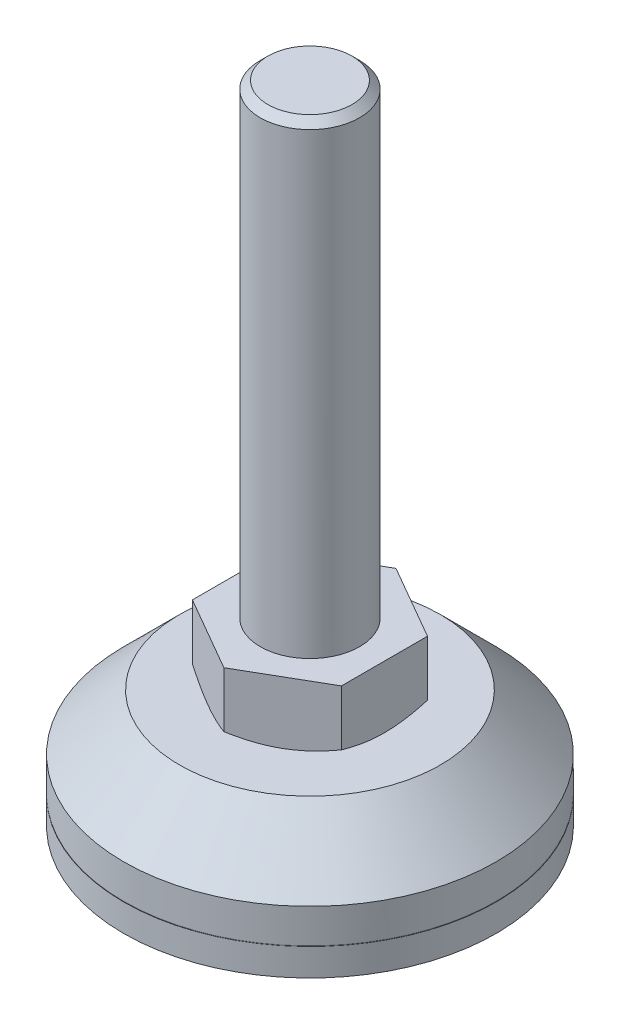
ISO-10303-21;
HEADER;
FILE_DESCRIPTION(('STEP AP214'),'2;1');
FILE_NAME('part.step','',(''),(''),'','','');
FILE_SCHEMA(('AUTOMOTIVE_DESIGN { 1 0 10303 214 1 1 1 1 }'));
ENDSEC;
DATA;
#1=APPLICATION_CONTEXT('core data for automotive mechanical design processes');
#2=APPLICATION_PROTOCOL_DEFINITION('international standard','automotive_design',2000,#1);
#3=PRODUCT_CONTEXT('',#1,'mechanical');
#4=PRODUCT('Part','Part','',(#3));
#5=PRODUCT_RELATED_PRODUCT_CATEGORY('part','',(#4));
#6=PRODUCT_DEFINITION_FORMATION('','',#4);
#7=PRODUCT_DEFINITION_CONTEXT('part definition',#1,'design');
#8=PRODUCT_DEFINITION('design','',#6,#7);
#9=PRODUCT_DEFINITION_SHAPE('','',#8);
#10=(LENGTH_UNIT() NAMED_UNIT(*) SI_UNIT(.MILLI.,.METRE.));
#11=(NAMED_UNIT(*) PLANE_ANGLE_UNIT() SI_UNIT($,.RADIAN.));
#12=(NAMED_UNIT(*) SI_UNIT($,.STERADIAN.) SOLID_ANGLE_UNIT());
#13=UNCERTAINTY_MEASURE_WITH_UNIT(LENGTH_MEASURE(1.E-05),#10,'distance_accuracy_value','');
#14=(GEOMETRIC_REPRESENTATION_CONTEXT(3) GLOBAL_UNCERTAINTY_ASSIGNED_CONTEXT((#13)) GLOBAL_UNIT_ASSIGNED_CONTEXT((#10,
#11,#12)) REPRESENTATION_CONTEXT('',''));
#15=CARTESIAN_POINT('',(0.,0.,0.));
#16=DIRECTION('',(0.,0.,1.));
#17=DIRECTION('',(1.,0.,0.));
#18=AXIS2_PLACEMENT_3D('',#15,#16,#17);
#19=CARTESIAN_POINT('',(0.,0.,-30.));
#20=DIRECTION('',(0.,1.,0.));
#21=DIRECTION('',(0.,0.,1.));
#22=AXIS2_PLACEMENT_3D('',#19,#20,#21);
#23=PLANE('',#22);
#24=CARTESIAN_POINT('',(0.,0.,0.));
#25=DIRECTION('',(0.,1.,0.));
#26=DIRECTION('',(0.,0.,1.));
#27=AXIS2_PLACEMENT_3D('',#24,#25,#26);
#28=CIRCLE('',#27,30.);
#29=CARTESIAN_POINT('',(0.,0.,30.));
#30=VERTEX_POINT('',#29);
#31=EDGE_CURVE('E19',#30,#30,#28,.T.);
#32=ORIENTED_EDGE('',*,*,#31,.F.);
#33=EDGE_LOOP('',(#32));
#34=FACE_BOUND('',#33,.T.);
#35=ADVANCED_FACE('F16',(#34),#23,.F.);
#36=CARTESIAN_POINT('',(0.,19.,0.));
#37=DIRECTION('',(0.,1.,0.));
#38=DIRECTION('',(0.,0.,1.));
#39=AXIS2_PLACEMENT_3D('',#36,#37,#38);
#40=CYLINDRICAL_SURFACE('',#39,30.);
#41=CARTESIAN_POINT('',(0.,4.4,0.));
#42=DIRECTION('',(0.,1.,0.));
#43=DIRECTION('',(0.,0.,1.));
#44=AXIS2_PLACEMENT_3D('',#41,#42,#43);
#45=CIRCLE('',#44,30.);
#46=CARTESIAN_POINT('',(0.,4.4,30.));
#47=VERTEX_POINT('',#46);
#48=EDGE_CURVE('E338',#47,#47,#45,.F.);
#49=ORIENTED_EDGE('',*,*,#48,.T.);
#50=EDGE_LOOP('',(#49));
#51=FACE_BOUND('',#50,.T.);
#52=ORIENTED_EDGE('',*,*,#31,.T.);
#53=EDGE_LOOP('',(#52));
#54=FACE_BOUND('',#53,.T.);
#55=ADVANCED_FACE('F345',(#51,#54),#40,.T.);
#56=CARTESIAN_POINT('',(0.,4.4,-29.95));
#57=DIRECTION('',(0.,-1.,0.));
#58=DIRECTION('',(0.,0.,-1.));
#59=AXIS2_PLACEMENT_3D('',#56,#57,#58);
#60=PLANE('',#59);
#61=CARTESIAN_POINT('',(0.,4.4,0.));
#62=DIRECTION('',(0.,1.,0.));
#63=DIRECTION('',(0.,0.,1.));
#64=AXIS2_PLACEMENT_3D('',#61,#62,#63);
#65=CIRCLE('',#64,29.95);
#66=CARTESIAN_POINT('',(0.,4.4,29.95));
#67=VERTEX_POINT('',#66);
#68=EDGE_CURVE('E334',#67,#67,#65,.T.);
#69=ORIENTED_EDGE('',*,*,#68,.F.);
#70=EDGE_LOOP('',(#69));
#71=FACE_BOUND('',#70,.T.);
#72=ORIENTED_EDGE('',*,*,#48,.F.);
#73=EDGE_LOOP('',(#72));
#74=FACE_BOUND('',#73,.T.);
#75=ADVANCED_FACE('F352',(#71,#74),#60,.F.);
#76=CARTESIAN_POINT('',(0.,19.,0.));
#77=DIRECTION('',(0.,1.,0.));
#78=DIRECTION('',(0.,0.,1.));
#79=AXIS2_PLACEMENT_3D('',#76,#77,#78);
#80=CYLINDRICAL_SURFACE('',#79,29.95);
#81=CARTESIAN_POINT('',(0.,4.5,0.));
#82=DIRECTION('',(0.,1.,0.));
#83=DIRECTION('',(0.,0.,1.));
#84=AXIS2_PLACEMENT_3D('',#81,#82,#83);
#85=CIRCLE('',#84,29.95);
#86=CARTESIAN_POINT('',(0.,4.5,29.95));
#87=VERTEX_POINT('',#86);
#88=EDGE_CURVE('E329',#87,#87,#85,.F.);
#89=ORIENTED_EDGE('',*,*,#88,.T.);
#90=EDGE_LOOP('',(#89));
#91=FACE_BOUND('',#90,.T.);
#92=ORIENTED_EDGE('',*,*,#68,.T.);
#93=EDGE_LOOP('',(#92));
#94=FACE_BOUND('',#93,.T.);
#95=ADVANCED_FACE('F357',(#91,#94),#80,.T.);
#96=CARTESIAN_POINT('',(0.,4.5,-30.));
#97=DIRECTION('',(0.,1.,0.));
#98=DIRECTION('',(0.,0.,1.));
#99=AXIS2_PLACEMENT_3D('',#96,#97,#98);
#100=PLANE('',#99);
#101=CARTESIAN_POINT('',(0.,4.5,0.));
#102=DIRECTION('',(0.,1.,0.));
#103=DIRECTION('',(0.,0.,1.));
#104=AXIS2_PLACEMENT_3D('',#101,#102,#103);
#105=CIRCLE('',#104,30.);
#106=CARTESIAN_POINT('',(0.,4.5,30.));
#107=VERTEX_POINT('',#106);
#108=EDGE_CURVE('E318',#107,#107,#105,.T.);
#109=ORIENTED_EDGE('',*,*,#108,.F.);
#110=EDGE_LOOP('',(#109));
#111=FACE_BOUND('',#110,.T.);
#112=ORIENTED_EDGE('',*,*,#88,.F.);
#113=EDGE_LOOP('',(#112));
#114=FACE_BOUND('',#113,.T.);
#115=ADVANCED_FACE('F363',(#111,#114),#100,.F.);
#116=CARTESIAN_POINT('',(0.,19.,0.));
#117=DIRECTION('',(0.,1.,0.));
#118=DIRECTION('',(0.,0.,1.));
#119=AXIS2_PLACEMENT_3D('',#116,#117,#118);
#120=CYLINDRICAL_SURFACE('',#119,30.);
#121=CARTESIAN_POINT('',(0.,10.,0.));
#122=DIRECTION('',(0.,-1.,0.));
#123=DIRECTION('',(0.,0.,-1.));
#124=AXIS2_PLACEMENT_3D('',#121,#122,#123);
#125=CIRCLE('',#124,30.);
#126=CARTESIAN_POINT('',(0.,10.,-30.));
#127=VERTEX_POINT('',#126);
#128=EDGE_CURVE('E315',#127,#127,#125,.F.);
#129=ORIENTED_EDGE('',*,*,#128,.F.);
#130=EDGE_LOOP('',(#129));
#131=FACE_BOUND('',#130,.T.);
#132=ORIENTED_EDGE('',*,*,#108,.T.);
#133=EDGE_LOOP('',(#132));
#134=FACE_BOUND('',#133,.T.);
#135=ADVANCED_FACE('F367',(#131,#134),#120,.T.);
#136=CARTESIAN_POINT('',(0.,10.,0.));
#137=DIRECTION('',(0.,-1.,0.));
#138=DIRECTION('',(0.,0.,-1.));
#139=AXIS2_PLACEMENT_3D('',#136,#137,#138);
#140=CONICAL_SURFACE('',#139,30.,0.785398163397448);
#141=CARTESIAN_POINT('',(0.,19.,0.));
#142=DIRECTION('',(0.,-1.,0.));
#143=DIRECTION('',(0.,0.,-1.));
#144=AXIS2_PLACEMENT_3D('',#141,#142,#143);
#145=CIRCLE('',#144,21.);
#146=CARTESIAN_POINT('',(0.,19.,-21.));
#147=VERTEX_POINT('',#146);
#148=EDGE_CURVE('E113',#147,#147,#145,.T.);
#149=ORIENTED_EDGE('',*,*,#148,.T.);
#150=EDGE_LOOP('',(#149));
#151=FACE_BOUND('',#150,.T.);
#152=ORIENTED_EDGE('',*,*,#128,.T.);
#153=EDGE_LOOP('',(#152));
#154=FACE_BOUND('',#153,.T.);
#155=ADVANCED_FACE('F370',(#151,#154),#140,.T.);
#156=CARTESIAN_POINT('',(0.,19.,-8.));
#157=DIRECTION('',(0.,-1.,0.));
#158=DIRECTION('',(0.,0.,-1.));
#159=AXIS2_PLACEMENT_3D('',#156,#157,#158);
#160=PLANE('',#159);
#161=CARTESIAN_POINT('',(0.,19.,0.));
#162=DIRECTION('',(0.,1.,0.));
#163=DIRECTION('',(0.,0.,1.));
#164=AXIS2_PLACEMENT_3D('',#161,#162,#163);
#165=CIRCLE('',#164,12.);
#166=CARTESIAN_POINT('',(6.,19.,-10.3923048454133));
#167=VERTEX_POINT('',#166);
#168=CARTESIAN_POINT('',(-6.,19.,-10.3923048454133));
#169=VERTEX_POINT('',#168);
#170=EDGE_CURVE('E520',#167,#169,#165,.T.);
#171=ORIENTED_EDGE('',*,*,#170,.F.);
#172=CARTESIAN_POINT('',(0.,19.,0.));
#173=DIRECTION('',(0.,1.,0.));
#174=DIRECTION('',(0.,0.,1.));
#175=AXIS2_PLACEMENT_3D('',#172,#173,#174);
#176=CIRCLE('',#175,12.);
#177=CARTESIAN_POINT('',(12.,19.,0.));
#178=VERTEX_POINT('',#177);
#179=EDGE_CURVE('E156',#178,#167,#176,.T.);
#180=ORIENTED_EDGE('',*,*,#179,.F.);
#181=CARTESIAN_POINT('',(0.,19.,0.));
#182=DIRECTION('',(0.,1.,0.));
#183=DIRECTION('',(0.,0.,1.));
#184=AXIS2_PLACEMENT_3D('',#181,#182,#183);
#185=CIRCLE('',#184,12.);
#186=CARTESIAN_POINT('',(6.,19.,10.3923048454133));
#187=VERTEX_POINT('',#186);
#188=EDGE_CURVE('E554',#187,#178,#185,.T.);
#189=ORIENTED_EDGE('',*,*,#188,.F.);
#190=CARTESIAN_POINT('',(0.,19.,0.));
#191=DIRECTION('',(0.,1.,0.));
#192=DIRECTION('',(0.,0.,1.));
#193=AXIS2_PLACEMENT_3D('',#190,#191,#192);
#194=CIRCLE('',#193,12.);
#195=CARTESIAN_POINT('',(-6.,19.,10.3923048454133));
#196=VERTEX_POINT('',#195);
#197=EDGE_CURVE('E93',#196,#187,#194,.T.);
#198=ORIENTED_EDGE('',*,*,#197,.F.);
#199=CARTESIAN_POINT('',(0.,19.,0.));
#200=DIRECTION('',(0.,1.,0.));
#201=DIRECTION('',(0.,0.,1.));
#202=AXIS2_PLACEMENT_3D('',#199,#200,#201);
#203=CIRCLE('',#202,12.);
#204=CARTESIAN_POINT('',(-12.,19.,0.));
#205=VERTEX_POINT('',#204);
#206=EDGE_CURVE('E88',#205,#196,#203,.T.);
#207=ORIENTED_EDGE('',*,*,#206,.F.);
#208=CARTESIAN_POINT('',(0.,19.,0.));
#209=DIRECTION('',(0.,1.,0.));
#210=DIRECTION('',(0.,0.,1.));
#211=AXIS2_PLACEMENT_3D('',#208,#209,#210);
#212=CIRCLE('',#211,12.);
#213=EDGE_CURVE('E85',#169,#205,#212,.T.);
#214=ORIENTED_EDGE('',*,*,#213,.F.);
#215=EDGE_LOOP('',(#171,#180,#189,#198,#207,#214));
#216=FACE_BOUND('',#215,.T.);
#217=ORIENTED_EDGE('',*,*,#148,.F.);
#218=EDGE_LOOP('',(#217));
#219=FACE_BOUND('',#218,.T.);
#220=ADVANCED_FACE('F90',(#216,#219),#160,.F.);
#221=CARTESIAN_POINT('',(0.,20.0782275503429,0.));
#222=DIRECTION('',(0.,1.,0.));
#223=DIRECTION('',(0.,0.,1.));
#224=AXIS2_PLACEMENT_3D('',#221,#222,#223);
#225=CONICAL_SURFACE('',#224,13.8675448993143,1.0471975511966);
#226=CARTESIAN_POINT('',(-12.,19.,0.));
#227=CARTESIAN_POINT('',(-12.,18.9999506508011,-0.294063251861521));
#228=CARTESIAN_POINT('',(-12.,19.0062393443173,-0.588112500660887));
#229=CARTESIAN_POINT('',(-12.,19.0311273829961,-1.17563362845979));
#230=CARTESIAN_POINT('',(-12.,19.0497242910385,-1.46910561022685));
#231=CARTESIAN_POINT('',(-12.,19.0987408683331,-2.05357628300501));
#232=CARTESIAN_POINT('',(-12.,19.1291010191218,-2.34458000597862));
#233=CARTESIAN_POINT('',(-12.,19.2009955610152,-2.92520230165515));
#234=CARTESIAN_POINT('',(-12.,19.2425302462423,-3.21482083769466));
#235=CARTESIAN_POINT('',(-12.,19.335926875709,-3.79202295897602));
#236=CARTESIAN_POINT('',(-12.,19.3877763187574,-4.0796085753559));
#237=CARTESIAN_POINT('',(-12.,19.5009500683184,-4.65290698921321));
#238=CARTESIAN_POINT('',(-12.,19.5622749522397,-4.93861967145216));
#239=CARTESIAN_POINT('',(-12.,19.7597552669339,-5.79563880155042));
#240=CARTESIAN_POINT('',(-12.,19.9089407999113,-6.36399154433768));
#241=CARTESIAN_POINT('',(-12.,20.0717967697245,-6.92820323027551));
#242=B_SPLINE_CURVE_WITH_KNOTS('',3,(#226,#227,#228,#229,#230,#231,#232,#233,#234,#235,#236,
#237,#238,#239,#240,#241),.UNSPECIFIED.,.F.,.F.,(4,2,2,2,2,2,2,4),(0.,0.8821000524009,
1.76402549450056,2.64154573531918,3.51908907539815,4.39557526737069,5.27211489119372,
7.03380287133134),.UNSPECIFIED.);
#243=CARTESIAN_POINT('',(-12.,20.0717967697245,-6.9282032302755));
#244=VERTEX_POINT('',#243);
#245=EDGE_CURVE('E105',#205,#244,#242,.T.);
#246=ORIENTED_EDGE('',*,*,#245,.T.);
#247=CARTESIAN_POINT('',(-12.,20.0717967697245,-6.92820323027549));
#248=CARTESIAN_POINT('',(-11.5113783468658,19.9089407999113,-7.2103090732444));
#249=CARTESIAN_POINT('',(-11.0191704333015,19.7597552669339,-7.49448544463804));
#250=CARTESIAN_POINT('',(-10.2769700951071,19.5622749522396,-7.92299500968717));
#251=CARTESIAN_POINT('',(-10.0295356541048,19.5009500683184,-8.06585135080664));
#252=CARTESIAN_POINT('',(-9.53304466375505,19.3877763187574,-8.3525005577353));
#253=CARTESIAN_POINT('',(-9.28398821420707,19.335926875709,-8.49629336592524));
#254=CARTESIAN_POINT('',(-8.78411651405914,19.2425302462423,-8.78489442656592));
#255=CARTESIAN_POINT('',(-8.53329950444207,19.2009955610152,-8.92970369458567));
#256=CARTESIAN_POINT('',(-8.03046584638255,19.1291010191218,-9.22001484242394));
#257=CARTESIAN_POINT('',(-7.77844922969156,19.0987408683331,-9.36551670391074));
#258=CARTESIAN_POINT('',(-7.27228277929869,19.0497242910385,-9.65775204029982));
#259=CARTESIAN_POINT('',(-7.01812858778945,19.0311273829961,-9.80448803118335));
#260=CARTESIAN_POINT('',(-6.50932036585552,19.0062393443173,-10.0982485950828));
#261=CARTESIAN_POINT('',(-6.25466624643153,18.9999506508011,-10.2452732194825));
#262=CARTESIAN_POINT('',(-6.,19.,-10.3923048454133));
#263=B_SPLINE_CURVE_WITH_KNOTS('',3,(#247,#248,#249,#250,#251,#252,#253,#254,#255,#256,#257,
#258,#259,#260,#261,#262),.UNSPECIFIED.,.F.,.F.,(4,2,2,2,2,2,2,4),(0.,1.76168798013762,
2.63822760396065,3.51471379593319,4.39225713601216,5.26977737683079,6.15170281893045,
7.03380287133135),.UNSPECIFIED.);
#264=EDGE_CURVE('E111',#244,#169,#263,.T.);
#265=ORIENTED_EDGE('',*,*,#264,.T.);
#266=ORIENTED_EDGE('',*,*,#213,.T.);
#267=EDGE_LOOP('',(#246,#265,#266));
#268=FACE_BOUND('',#267,.T.);
#269=ADVANCED_FACE('F109',(#268),#225,.T.);
#270=CARTESIAN_POINT('',(0.,20.0782275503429,0.));
#271=DIRECTION('',(0.,1.,0.));
#272=DIRECTION('',(0.,0.,1.));
#273=AXIS2_PLACEMENT_3D('',#270,#271,#272);
#274=CONICAL_SURFACE('',#273,13.8675448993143,1.0471975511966);
#275=CARTESIAN_POINT('',(-6.,19.,10.3923048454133));
#276=CARTESIAN_POINT('',(-6.25466624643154,18.9999506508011,10.2452732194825));
#277=CARTESIAN_POINT('',(-6.50932036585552,19.0062393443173,10.0982485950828));
#278=CARTESIAN_POINT('',(-7.01812858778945,19.0311273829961,9.80448803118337));
#279=CARTESIAN_POINT('',(-7.2722827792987,19.0497242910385,9.65775204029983));
#280=CARTESIAN_POINT('',(-7.77844922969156,19.0987408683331,9.36551670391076));
#281=CARTESIAN_POINT('',(-8.03046584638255,19.1291010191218,9.22001484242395));
#282=CARTESIAN_POINT('',(-8.53329950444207,19.2009955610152,8.92970369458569));
#283=CARTESIAN_POINT('',(-8.78411651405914,19.2425302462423,8.78489442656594));
#284=CARTESIAN_POINT('',(-9.28398821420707,19.335926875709,8.49629336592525));
#285=CARTESIAN_POINT('',(-9.53304466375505,19.3877763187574,8.35250055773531));
#286=CARTESIAN_POINT('',(-10.0295356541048,19.5009500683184,8.06585135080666));
#287=CARTESIAN_POINT('',(-10.2769700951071,19.5622749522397,7.92299500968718));
#288=CARTESIAN_POINT('',(-11.0191704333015,19.7597552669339,7.49448544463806));
#289=CARTESIAN_POINT('',(-11.5113783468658,19.9089407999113,7.21030907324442));
#290=CARTESIAN_POINT('',(-12.,20.0717967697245,6.92820323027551));
#291=B_SPLINE_CURVE_WITH_KNOTS('',3,(#275,#276,#277,#278,#279,#280,#281,#282,#283,#284,#285,
#286,#287,#288,#289,#290),.UNSPECIFIED.,.F.,.F.,(4,2,2,2,2,2,2,4),(0.,0.882100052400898,
1.76402549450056,2.64154573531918,3.51908907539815,4.39557526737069,5.27211489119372,
7.03380287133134),.UNSPECIFIED.);
#292=CARTESIAN_POINT('',(-12.,20.0717967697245,6.92820323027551));
#293=VERTEX_POINT('',#292);
#294=EDGE_CURVE('E101',#196,#293,#291,.T.);
#295=ORIENTED_EDGE('',*,*,#294,.T.);
#296=CARTESIAN_POINT('',(-12.,20.0717967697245,6.92820323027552));
#297=CARTESIAN_POINT('',(-12.,19.9089407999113,6.36399154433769));
#298=CARTESIAN_POINT('',(-12.,19.7597552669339,5.79563880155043));
#299=CARTESIAN_POINT('',(-12.,19.5622749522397,4.93861967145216));
#300=CARTESIAN_POINT('',(-12.,19.5009500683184,4.65290698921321));
#301=CARTESIAN_POINT('',(-12.,19.3877763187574,4.07960857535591));
#302=CARTESIAN_POINT('',(-12.,19.335926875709,3.79202295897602));
#303=CARTESIAN_POINT('',(-12.,19.2425302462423,3.21482083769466));
#304=CARTESIAN_POINT('',(-12.,19.2009955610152,2.92520230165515));
#305=CARTESIAN_POINT('',(-12.,19.1291010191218,2.34458000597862));
#306=CARTESIAN_POINT('',(-12.,19.0987408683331,2.05357628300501));
#307=CARTESIAN_POINT('',(-12.,19.0497242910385,1.46910561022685));
#308=CARTESIAN_POINT('',(-12.,19.0311273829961,1.17563362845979));
#309=CARTESIAN_POINT('',(-12.,19.0062393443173,0.588112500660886));
#310=CARTESIAN_POINT('',(-12.,18.9999506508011,0.294063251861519));
#311=CARTESIAN_POINT('',(-12.,19.,0.));
#312=B_SPLINE_CURVE_WITH_KNOTS('',3,(#296,#297,#298,#299,#300,#301,#302,#303,#304,#305,#306,
#307,#308,#309,#310,#311),.UNSPECIFIED.,.F.,.F.,(4,2,2,2,2,2,2,4),(0.,1.76168798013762,
2.63822760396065,3.51471379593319,4.39225713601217,5.26977737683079,6.15170281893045,
7.03380287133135),.UNSPECIFIED.);
#313=EDGE_CURVE('E99',#293,#205,#312,.T.);
#314=ORIENTED_EDGE('',*,*,#313,.T.);
#315=ORIENTED_EDGE('',*,*,#206,.T.);
#316=EDGE_LOOP('',(#295,#314,#315));
#317=FACE_BOUND('',#316,.T.);
#318=ADVANCED_FACE('F100',(#317),#274,.T.);
#319=CARTESIAN_POINT('',(0.,20.0782275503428,0.));
#320=DIRECTION('',(0.,1.,0.));
#321=DIRECTION('',(0.,0.,1.));
#322=AXIS2_PLACEMENT_3D('',#319,#320,#321);
#323=CONICAL_SURFACE('',#322,13.8675448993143,1.0471975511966);
#324=CARTESIAN_POINT('',(6.,19.,10.3923048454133));
#325=CARTESIAN_POINT('',(5.74533375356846,18.9999506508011,10.539336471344));
#326=CARTESIAN_POINT('',(5.49067963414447,19.0062393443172,10.6863610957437));
#327=CARTESIAN_POINT('',(4.98187141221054,19.0311273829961,10.9801216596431));
#328=CARTESIAN_POINT('',(4.72771722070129,19.0497242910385,11.1268576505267));
#329=CARTESIAN_POINT('',(4.22155077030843,19.0987408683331,11.4190929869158));
#330=CARTESIAN_POINT('',(3.96953415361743,19.1291010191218,11.5645948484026));
#331=CARTESIAN_POINT('',(3.46670049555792,19.2009955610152,11.8549059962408));
#332=CARTESIAN_POINT('',(3.21588348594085,19.2425302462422,11.9997152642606));
#333=CARTESIAN_POINT('',(2.71601178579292,19.335926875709,12.2883163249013));
#334=CARTESIAN_POINT('',(2.46695533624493,19.3877763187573,12.4321091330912));
#335=CARTESIAN_POINT('',(1.97046434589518,19.5009500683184,12.7187583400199));
#336=CARTESIAN_POINT('',(1.72302990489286,19.5622749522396,12.8616146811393));
#337=CARTESIAN_POINT('',(0.980829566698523,19.7597552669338,13.2901242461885));
#338=CARTESIAN_POINT('',(0.488621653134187,19.9089407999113,13.5743006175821));
#339=CARTESIAN_POINT('',(0.,20.0717967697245,13.856406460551));
#340=B_SPLINE_CURVE_WITH_KNOTS('',3,(#324,#325,#326,#327,#328,#329,#330,#331,#332,#333,#334,
#335,#336,#337,#338,#339),.UNSPECIFIED.,.F.,.F.,(4,2,2,2,2,2,2,4),(0.,0.882100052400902,
1.76402549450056,2.64154573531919,3.51908907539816,4.3955752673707,5.27211489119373,
7.03380287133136),.UNSPECIFIED.);
#341=CARTESIAN_POINT('',(0.,20.0717967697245,13.856406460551));
#342=VERTEX_POINT('',#341);
#343=EDGE_CURVE('E237',#187,#342,#340,.T.);
#344=ORIENTED_EDGE('',*,*,#343,.T.);
#345=CARTESIAN_POINT('',(0.,20.0717967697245,13.856406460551));
#346=CARTESIAN_POINT('',(-0.488621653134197,19.9089407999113,13.5743006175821));
#347=CARTESIAN_POINT('',(-0.980829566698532,19.7597552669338,13.2901242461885));
#348=CARTESIAN_POINT('',(-1.72302990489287,19.5622749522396,12.8616146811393));
#349=CARTESIAN_POINT('',(-1.97046434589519,19.5009500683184,12.7187583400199));
#350=CARTESIAN_POINT('',(-2.46695533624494,19.3877763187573,12.4321091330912));
#351=CARTESIAN_POINT('',(-2.71601178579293,19.335926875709,12.2883163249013));
#352=CARTESIAN_POINT('',(-3.21588348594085,19.2425302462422,11.9997152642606));
#353=CARTESIAN_POINT('',(-3.46670049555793,19.2009955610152,11.8549059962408));
#354=CARTESIAN_POINT('',(-3.96953415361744,19.1291010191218,11.5645948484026));
#355=CARTESIAN_POINT('',(-4.22155077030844,19.0987408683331,11.4190929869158));
#356=CARTESIAN_POINT('',(-4.7277172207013,19.0497242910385,11.1268576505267));
#357=CARTESIAN_POINT('',(-4.98187141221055,19.0311273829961,10.9801216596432));
#358=CARTESIAN_POINT('',(-5.49067963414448,19.0062393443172,10.6863610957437));
#359=CARTESIAN_POINT('',(-5.74533375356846,18.9999506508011,10.539336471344));
#360=CARTESIAN_POINT('',(-6.,19.,10.3923048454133));
#361=B_SPLINE_CURVE_WITH_KNOTS('',3,(#345,#346,#347,#348,#349,#350,#351,#352,#353,#354,#355,
#356,#357,#358,#359,#360),.UNSPECIFIED.,.F.,.F.,(4,2,2,2,2,2,2,4),(0.,1.76168798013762,
2.63822760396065,3.51471379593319,4.39225713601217,5.26977737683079,6.15170281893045,
7.03380287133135),.UNSPECIFIED.);
#362=EDGE_CURVE('E120',#342,#196,#361,.T.);
#363=ORIENTED_EDGE('',*,*,#362,.T.);
#364=ORIENTED_EDGE('',*,*,#197,.T.);
#365=EDGE_LOOP('',(#344,#363,#364));
#366=FACE_BOUND('',#365,.T.);
#367=ADVANCED_FACE('F226',(#366),#323,.T.);
#368=CARTESIAN_POINT('',(0.,20.0782275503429,0.));
#369=DIRECTION('',(0.,1.,0.));
#370=DIRECTION('',(0.,0.,1.));
#371=AXIS2_PLACEMENT_3D('',#368,#369,#370);
#372=CONICAL_SURFACE('',#371,13.8675448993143,1.0471975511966);
#373=CARTESIAN_POINT('',(12.,19.,0.));
#374=CARTESIAN_POINT('',(12.,18.9999506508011,0.294063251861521));
#375=CARTESIAN_POINT('',(12.,19.0062393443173,0.588112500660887));
#376=CARTESIAN_POINT('',(12.,19.0311273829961,1.17563362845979));
#377=CARTESIAN_POINT('',(12.,19.0497242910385,1.46910561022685));
#378=CARTESIAN_POINT('',(12.,19.0987408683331,2.05357628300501));
#379=CARTESIAN_POINT('',(12.,19.1291010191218,2.34458000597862));
#380=CARTESIAN_POINT('',(12.,19.2009955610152,2.92520230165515));
#381=CARTESIAN_POINT('',(12.,19.2425302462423,3.21482083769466));
#382=CARTESIAN_POINT('',(12.,19.335926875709,3.79202295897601));
#383=CARTESIAN_POINT('',(12.,19.3877763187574,4.0796085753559));
#384=CARTESIAN_POINT('',(12.,19.5009500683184,4.65290698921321));
#385=CARTESIAN_POINT('',(12.,19.5622749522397,4.93861967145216));
#386=CARTESIAN_POINT('',(12.,19.7597552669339,5.79563880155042));
#387=CARTESIAN_POINT('',(12.,19.9089407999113,6.36399154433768));
#388=CARTESIAN_POINT('',(12.,20.0717967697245,6.92820323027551));
#389=B_SPLINE_CURVE_WITH_KNOTS('',3,(#373,#374,#375,#376,#377,#378,#379,#380,#381,#382,#383,
#384,#385,#386,#387,#388),.UNSPECIFIED.,.F.,.F.,(4,2,2,2,2,2,2,4),(0.,0.8821000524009,
1.76402549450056,2.64154573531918,3.51908907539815,4.39557526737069,5.27211489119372,
7.03380287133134),.UNSPECIFIED.);
#390=CARTESIAN_POINT('',(12.,20.0717967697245,6.9282032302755));
#391=VERTEX_POINT('',#390);
#392=EDGE_CURVE('E217',#178,#391,#389,.T.);
#393=ORIENTED_EDGE('',*,*,#392,.T.);
#394=CARTESIAN_POINT('',(12.,20.0717967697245,6.92820323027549));
#395=CARTESIAN_POINT('',(11.5113783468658,19.9089407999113,7.2103090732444));
#396=CARTESIAN_POINT('',(11.0191704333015,19.7597552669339,7.49448544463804));
#397=CARTESIAN_POINT('',(10.2769700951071,19.5622749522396,7.92299500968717));
#398=CARTESIAN_POINT('',(10.0295356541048,19.5009500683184,8.06585135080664));
#399=CARTESIAN_POINT('',(9.53304466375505,19.3877763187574,8.3525005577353));
#400=CARTESIAN_POINT('',(9.28398821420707,19.335926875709,8.49629336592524));
#401=CARTESIAN_POINT('',(8.78411651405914,19.2425302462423,8.78489442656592));
#402=CARTESIAN_POINT('',(8.53329950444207,19.2009955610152,8.92970369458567));
#403=CARTESIAN_POINT('',(8.03046584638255,19.1291010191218,9.22001484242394));
#404=CARTESIAN_POINT('',(7.77844922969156,19.0987408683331,9.36551670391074));
#405=CARTESIAN_POINT('',(7.27228277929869,19.0497242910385,9.65775204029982));
#406=CARTESIAN_POINT('',(7.01812858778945,19.0311273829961,9.80448803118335));
#407=CARTESIAN_POINT('',(6.50932036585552,19.0062393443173,10.0982485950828));
#408=CARTESIAN_POINT('',(6.25466624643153,18.9999506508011,10.2452732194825));
#409=CARTESIAN_POINT('',(6.,19.,10.3923048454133));
#410=B_SPLINE_CURVE_WITH_KNOTS('',3,(#394,#395,#396,#397,#398,#399,#400,#401,#402,#403,#404,
#405,#406,#407,#408,#409),.UNSPECIFIED.,.F.,.F.,(4,2,2,2,2,2,2,4),(0.,1.76168798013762,
2.63822760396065,3.51471379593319,4.39225713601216,5.26977737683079,6.15170281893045,
7.03380287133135),.UNSPECIFIED.);
#411=EDGE_CURVE('E231',#391,#187,#410,.T.);
#412=ORIENTED_EDGE('',*,*,#411,.T.);
#413=ORIENTED_EDGE('',*,*,#188,.T.);
#414=EDGE_LOOP('',(#393,#412,#413));
#415=FACE_BOUND('',#414,.T.);
#416=ADVANCED_FACE('F223',(#415),#372,.T.);
#417=CARTESIAN_POINT('',(0.,20.0782275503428,0.));
#418=DIRECTION('',(0.,1.,0.));
#419=DIRECTION('',(0.,0.,1.));
#420=AXIS2_PLACEMENT_3D('',#417,#418,#419);
#421=CONICAL_SURFACE('',#420,13.8675448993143,1.0471975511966);
#422=CARTESIAN_POINT('',(0.,20.0717967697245,-13.856406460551));
#423=CARTESIAN_POINT('',(0.488621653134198,19.9089407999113,-13.5743006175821));
#424=CARTESIAN_POINT('',(0.980829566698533,19.7597552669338,-13.2901242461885));
#425=CARTESIAN_POINT('',(1.72302990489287,19.5622749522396,-12.8616146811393));
#426=CARTESIAN_POINT('',(1.97046434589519,19.5009500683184,-12.7187583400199));
#427=CARTESIAN_POINT('',(2.46695533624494,19.3877763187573,-12.4321091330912));
#428=CARTESIAN_POINT('',(2.71601178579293,19.335926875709,-12.2883163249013));
#429=CARTESIAN_POINT('',(3.21588348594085,19.2425302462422,-11.9997152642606));
#430=CARTESIAN_POINT('',(3.46670049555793,19.2009955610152,-11.8549059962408));
#431=CARTESIAN_POINT('',(3.96953415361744,19.1291010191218,-11.5645948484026));
#432=CARTESIAN_POINT('',(4.22155077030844,19.0987408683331,-11.4190929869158));
#433=CARTESIAN_POINT('',(4.7277172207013,19.0497242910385,-11.1268576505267));
#434=CARTESIAN_POINT('',(4.98187141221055,19.0311273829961,-10.9801216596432));
#435=CARTESIAN_POINT('',(5.49067963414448,19.0062393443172,-10.6863610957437));
#436=CARTESIAN_POINT('',(5.74533375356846,18.9999506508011,-10.539336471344));
#437=CARTESIAN_POINT('',(6.,19.,-10.3923048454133));
#438=B_SPLINE_CURVE_WITH_KNOTS('',3,(#422,#423,#424,#425,#426,#427,#428,#429,#430,#431,#432,
#433,#434,#435,#436,#437),.UNSPECIFIED.,.F.,.F.,(4,2,2,2,2,2,2,4),(0.,1.76168798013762,
2.63822760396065,3.51471379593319,4.39225713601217,5.26977737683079,6.15170281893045,
7.03380287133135),.UNSPECIFIED.);
#439=CARTESIAN_POINT('',(0.,20.0717967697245,-13.856406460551));
#440=VERTEX_POINT('',#439);
#441=EDGE_CURVE('E195',#440,#167,#438,.T.);
#442=ORIENTED_EDGE('',*,*,#441,.T.);
#443=ORIENTED_EDGE('',*,*,#170,.T.);
#444=CARTESIAN_POINT('',(-6.,19.,-10.3923048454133));
#445=CARTESIAN_POINT('',(-5.74533375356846,18.9999506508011,-10.539336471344));
#446=CARTESIAN_POINT('',(-5.49067963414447,19.0062393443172,-10.6863610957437));
#447=CARTESIAN_POINT('',(-4.98187141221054,19.0311273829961,-10.9801216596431));
#448=CARTESIAN_POINT('',(-4.72771722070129,19.0497242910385,-11.1268576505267));
#449=CARTESIAN_POINT('',(-4.22155077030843,19.0987408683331,-11.4190929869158));
#450=CARTESIAN_POINT('',(-3.96953415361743,19.1291010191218,-11.5645948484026));
#451=CARTESIAN_POINT('',(-3.46670049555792,19.2009955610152,-11.8549059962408));
#452=CARTESIAN_POINT('',(-3.21588348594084,19.2425302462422,-11.9997152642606));
#453=CARTESIAN_POINT('',(-2.71601178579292,19.335926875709,-12.2883163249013));
#454=CARTESIAN_POINT('',(-2.46695533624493,19.3877763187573,-12.4321091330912));
#455=CARTESIAN_POINT('',(-1.97046434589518,19.5009500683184,-12.7187583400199));
#456=CARTESIAN_POINT('',(-1.72302990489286,19.5622749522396,-12.8616146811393));
#457=CARTESIAN_POINT('',(-0.980829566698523,19.7597552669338,-13.2901242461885));
#458=CARTESIAN_POINT('',(-0.488621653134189,19.9089407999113,-13.5743006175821));
#459=CARTESIAN_POINT('',(0.,20.0717967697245,-13.856406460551));
#460=B_SPLINE_CURVE_WITH_KNOTS('',3,(#444,#445,#446,#447,#448,#449,#450,#451,#452,#453,#454,
#455,#456,#457,#458,#459),.UNSPECIFIED.,.F.,.F.,(4,2,2,2,2,2,2,4),(0.,0.882100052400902,
1.76402549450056,2.64154573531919,3.51908907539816,4.3955752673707,5.27211489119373,
7.03380287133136),.UNSPECIFIED.);
#461=EDGE_CURVE('E106',#169,#440,#460,.T.);
#462=ORIENTED_EDGE('',*,*,#461,.T.);
#463=EDGE_LOOP('',(#442,#443,#462));
#464=FACE_BOUND('',#463,.T.);
#465=ADVANCED_FACE('F172',(#464),#421,.T.);
#466=CARTESIAN_POINT('',(0.,20.0782275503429,0.));
#467=DIRECTION('',(0.,1.,0.));
#468=DIRECTION('',(0.,0.,1.));
#469=AXIS2_PLACEMENT_3D('',#466,#467,#468);
#470=CONICAL_SURFACE('',#469,13.8675448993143,1.0471975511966);
#471=CARTESIAN_POINT('',(6.,19.,-10.3923048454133));
#472=CARTESIAN_POINT('',(6.25466624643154,18.9999506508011,-10.2452732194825));
#473=CARTESIAN_POINT('',(6.50932036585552,19.0062393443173,-10.0982485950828));
#474=CARTESIAN_POINT('',(7.01812858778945,19.0311273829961,-9.80448803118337));
#475=CARTESIAN_POINT('',(7.2722827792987,19.0497242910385,-9.65775204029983));
#476=CARTESIAN_POINT('',(7.77844922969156,19.0987408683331,-9.36551670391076));
#477=CARTESIAN_POINT('',(8.03046584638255,19.1291010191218,-9.22001484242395));
#478=CARTESIAN_POINT('',(8.53329950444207,19.2009955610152,-8.92970369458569));
#479=CARTESIAN_POINT('',(8.78411651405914,19.2425302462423,-8.78489442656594));
#480=CARTESIAN_POINT('',(9.28398821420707,19.335926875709,-8.49629336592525));
#481=CARTESIAN_POINT('',(9.53304466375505,19.3877763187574,-8.35250055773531));
#482=CARTESIAN_POINT('',(10.0295356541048,19.5009500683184,-8.06585135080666));
#483=CARTESIAN_POINT('',(10.2769700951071,19.5622749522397,-7.92299500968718));
#484=CARTESIAN_POINT('',(11.0191704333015,19.7597552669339,-7.49448544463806));
#485=CARTESIAN_POINT('',(11.5113783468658,19.9089407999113,-7.21030907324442));
#486=CARTESIAN_POINT('',(12.,20.0717967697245,-6.92820323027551));
#487=B_SPLINE_CURVE_WITH_KNOTS('',3,(#471,#472,#473,#474,#475,#476,#477,#478,#479,#480,#481,
#482,#483,#484,#485,#486),.UNSPECIFIED.,.F.,.F.,(4,2,2,2,2,2,2,4),(0.,0.882100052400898,
1.76402549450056,2.64154573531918,3.51908907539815,4.39557526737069,5.27211489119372,
7.03380287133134),.UNSPECIFIED.);
#488=CARTESIAN_POINT('',(12.,20.0717967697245,-6.92820323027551));
#489=VERTEX_POINT('',#488);
#490=EDGE_CURVE('E187',#167,#489,#487,.T.);
#491=ORIENTED_EDGE('',*,*,#490,.T.);
#492=CARTESIAN_POINT('',(12.,20.0717967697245,-6.92820323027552));
#493=CARTESIAN_POINT('',(12.,19.9089407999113,-6.36399154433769));
#494=CARTESIAN_POINT('',(12.,19.7597552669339,-5.79563880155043));
#495=CARTESIAN_POINT('',(12.,19.5622749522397,-4.93861967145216));
#496=CARTESIAN_POINT('',(12.,19.5009500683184,-4.65290698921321));
#497=CARTESIAN_POINT('',(12.,19.3877763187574,-4.07960857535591));
#498=CARTESIAN_POINT('',(12.,19.335926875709,-3.79202295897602));
#499=CARTESIAN_POINT('',(12.,19.2425302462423,-3.21482083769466));
#500=CARTESIAN_POINT('',(12.,19.2009955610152,-2.92520230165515));
#501=CARTESIAN_POINT('',(12.,19.1291010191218,-2.34458000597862));
#502=CARTESIAN_POINT('',(12.,19.0987408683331,-2.05357628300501));
#503=CARTESIAN_POINT('',(12.,19.0497242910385,-1.46910561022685));
#504=CARTESIAN_POINT('',(12.,19.0311273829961,-1.17563362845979));
#505=CARTESIAN_POINT('',(12.,19.0062393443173,-0.588112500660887));
#506=CARTESIAN_POINT('',(12.,18.9999506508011,-0.29406325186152));
#507=CARTESIAN_POINT('',(12.,19.,0.));
#508=B_SPLINE_CURVE_WITH_KNOTS('',3,(#492,#493,#494,#495,#496,#497,#498,#499,#500,#501,#502,
#503,#504,#505,#506,#507),.UNSPECIFIED.,.F.,.F.,(4,2,2,2,2,2,2,4),(0.,1.76168798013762,
2.63822760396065,3.51471379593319,4.39225713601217,5.26977737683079,6.15170281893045,
7.03380287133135),.UNSPECIFIED.);
#509=EDGE_CURVE('E178',#489,#178,#508,.T.);
#510=ORIENTED_EDGE('',*,*,#509,.T.);
#511=ORIENTED_EDGE('',*,*,#179,.T.);
#512=EDGE_LOOP('',(#491,#510,#511));
#513=FACE_BOUND('',#512,.T.);
#514=ADVANCED_FACE('F167',(#513),#470,.T.);
#515=CARTESIAN_POINT('',(0.,29.,-13.856406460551));
#516=DIRECTION('',(0.5,0.,0.866025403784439));
#517=DIRECTION('',(0.866025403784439,0.,-0.5));
#518=AXIS2_PLACEMENT_3D('',#515,#516,#517);
#519=PLANE('',#518);
#520=ORIENTED_EDGE('',*,*,#461,.F.);
#521=ORIENTED_EDGE('',*,*,#264,.F.);
#522=DIRECTION('',(0.,1.,0.));
#523=VECTOR('',#522,1.);
#524=CARTESIAN_POINT('',(-12.,29.,-6.92820323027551));
#525=LINE('',#524,#523);
#526=CARTESIAN_POINT('',(-12.,29.,-6.92820323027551));
#527=VERTEX_POINT('',#526);
#528=EDGE_CURVE('E118',#244,#527,#525,.T.);
#529=ORIENTED_EDGE('',*,*,#528,.T.);
#530=DIRECTION('',(-0.866025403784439,0.,0.5));
#531=VECTOR('',#530,1.);
#532=CARTESIAN_POINT('',(0.,29.,-13.856406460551));
#533=LINE('',#532,#531);
#534=CARTESIAN_POINT('',(0.,29.,-13.856406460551));
#535=VERTEX_POINT('',#534);
#536=EDGE_CURVE('E301',#535,#527,#533,.T.);
#537=ORIENTED_EDGE('',*,*,#536,.F.);
#538=DIRECTION('',(0.,1.,0.));
#539=VECTOR('',#538,1.);
#540=CARTESIAN_POINT('',(0.,29.,-13.856406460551));
#541=LINE('',#540,#539);
#542=EDGE_CURVE('E525',#535,#440,#541,.F.);
#543=ORIENTED_EDGE('',*,*,#542,.T.);
#544=EDGE_LOOP('',(#520,#521,#529,#537,#543));
#545=FACE_BOUND('',#544,.T.);
#546=ADVANCED_FACE('F163',(#545),#519,.F.);
#547=CARTESIAN_POINT('',(-12.,29.,-6.92820323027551));
#548=DIRECTION('',(1.,0.,0.));
#549=DIRECTION('',(0.,0.,-1.));
#550=AXIS2_PLACEMENT_3D('',#547,#548,#549);
#551=PLANE('',#550);
#552=ORIENTED_EDGE('',*,*,#245,.F.);
#553=ORIENTED_EDGE('',*,*,#313,.F.);
#554=DIRECTION('',(0.,1.,0.));
#555=VECTOR('',#554,1.);
#556=CARTESIAN_POINT('',(-12.,29.,6.92820323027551));
#557=LINE('',#556,#555);
#558=CARTESIAN_POINT('',(-12.,29.,6.92820323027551));
#559=VERTEX_POINT('',#558);
#560=EDGE_CURVE('E238',#293,#559,#557,.T.);
#561=ORIENTED_EDGE('',*,*,#560,.T.);
#562=DIRECTION('',(0.,0.,1.));
#563=VECTOR('',#562,1.);
#564=CARTESIAN_POINT('',(-12.,29.,0.));
#565=LINE('',#564,#563);
#566=EDGE_CURVE('E303',#527,#559,#565,.T.);
#567=ORIENTED_EDGE('',*,*,#566,.F.);
#568=ORIENTED_EDGE('',*,*,#528,.F.);
#569=EDGE_LOOP('',(#552,#553,#561,#567,#568));
#570=FACE_BOUND('',#569,.T.);
#571=ADVANCED_FACE('F116',(#570),#551,.F.);
#572=CARTESIAN_POINT('',(-12.,29.,6.92820323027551));
#573=DIRECTION('',(0.5,0.,-0.866025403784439));
#574=DIRECTION('',(-0.866025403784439,0.,-0.5));
#575=AXIS2_PLACEMENT_3D('',#572,#573,#574);
#576=PLANE('',#575);
#577=ORIENTED_EDGE('',*,*,#294,.F.);
#578=ORIENTED_EDGE('',*,*,#362,.F.);
#579=DIRECTION('',(0.,1.,0.));
#580=VECTOR('',#579,1.);
#581=CARTESIAN_POINT('',(0.,29.,13.856406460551));
#582=LINE('',#581,#580);
#583=CARTESIAN_POINT('',(0.,29.,13.856406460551));
#584=VERTEX_POINT('',#583);
#585=EDGE_CURVE('E540',#342,#584,#582,.T.);
#586=ORIENTED_EDGE('',*,*,#585,.T.);
#587=DIRECTION('',(0.866025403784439,0.,0.5));
#588=VECTOR('',#587,1.);
#589=CARTESIAN_POINT('',(-12.,29.,6.92820323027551));
#590=LINE('',#589,#588);
#591=EDGE_CURVE('E294',#559,#584,#590,.T.);
#592=ORIENTED_EDGE('',*,*,#591,.F.);
#593=ORIENTED_EDGE('',*,*,#560,.F.);
#594=EDGE_LOOP('',(#577,#578,#586,#592,#593));
#595=FACE_BOUND('',#594,.T.);
#596=ADVANCED_FACE('F247',(#595),#576,.F.);
#597=CARTESIAN_POINT('',(0.,29.,13.856406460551));
#598=DIRECTION('',(-0.5,0.,-0.866025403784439));
#599=DIRECTION('',(-0.866025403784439,0.,0.5));
#600=AXIS2_PLACEMENT_3D('',#597,#598,#599);
#601=PLANE('',#600);
#602=ORIENTED_EDGE('',*,*,#343,.F.);
#603=ORIENTED_EDGE('',*,*,#411,.F.);
#604=DIRECTION('',(0.,1.,0.));
#605=VECTOR('',#604,1.);
#606=CARTESIAN_POINT('',(12.,29.,6.92820323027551));
#607=LINE('',#606,#605);
#608=CARTESIAN_POINT('',(12.,29.,6.92820323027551));
#609=VERTEX_POINT('',#608);
#610=EDGE_CURVE('E222',#391,#609,#607,.T.);
#611=ORIENTED_EDGE('',*,*,#610,.T.);
#612=DIRECTION('',(0.866025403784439,0.,-0.5));
#613=VECTOR('',#612,1.);
#614=CARTESIAN_POINT('',(0.,29.,13.856406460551));
#615=LINE('',#614,#613);
#616=EDGE_CURVE('E290',#584,#609,#615,.T.);
#617=ORIENTED_EDGE('',*,*,#616,.F.);
#618=ORIENTED_EDGE('',*,*,#585,.F.);
#619=EDGE_LOOP('',(#602,#603,#611,#617,#618));
#620=FACE_BOUND('',#619,.T.);
#621=ADVANCED_FACE('F214',(#620),#601,.F.);
#622=CARTESIAN_POINT('',(12.,29.,6.92820323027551));
#623=DIRECTION('',(-1.,0.,0.));
#624=DIRECTION('',(0.,0.,1.));
#625=AXIS2_PLACEMENT_3D('',#622,#623,#624);
#626=PLANE('',#625);
#627=ORIENTED_EDGE('',*,*,#392,.F.);
#628=ORIENTED_EDGE('',*,*,#509,.F.);
#629=DIRECTION('',(0.,1.,0.));
#630=VECTOR('',#629,1.);
#631=CARTESIAN_POINT('',(12.,29.,-6.92820323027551));
#632=LINE('',#631,#630);
#633=CARTESIAN_POINT('',(12.,29.,-6.92820323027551));
#634=VERTEX_POINT('',#633);
#635=EDGE_CURVE('E34',#489,#634,#632,.T.);
#636=ORIENTED_EDGE('',*,*,#635,.T.);
#637=DIRECTION('',(0.,0.,1.));
#638=VECTOR('',#637,1.);
#639=CARTESIAN_POINT('',(12.,29.,0.));
#640=LINE('',#639,#638);
#641=EDGE_CURVE('E285',#609,#634,#640,.F.);
#642=ORIENTED_EDGE('',*,*,#641,.F.);
#643=ORIENTED_EDGE('',*,*,#610,.F.);
#644=EDGE_LOOP('',(#627,#628,#636,#642,#643));
#645=FACE_BOUND('',#644,.T.);
#646=ADVANCED_FACE('F207',(#645),#626,.F.);
#647=CARTESIAN_POINT('',(12.,29.,-6.92820323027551));
#648=DIRECTION('',(-0.5,0.,0.866025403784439));
#649=DIRECTION('',(0.866025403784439,0.,0.5));
#650=AXIS2_PLACEMENT_3D('',#647,#648,#649);
#651=PLANE('',#650);
#652=ORIENTED_EDGE('',*,*,#490,.F.);
#653=ORIENTED_EDGE('',*,*,#441,.F.);
#654=ORIENTED_EDGE('',*,*,#542,.F.);
#655=DIRECTION('',(-0.866025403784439,0.,-0.5));
#656=VECTOR('',#655,1.);
#657=CARTESIAN_POINT('',(12.,29.,-6.92820323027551));
#658=LINE('',#657,#656);
#659=EDGE_CURVE('E287',#634,#535,#658,.T.);
#660=ORIENTED_EDGE('',*,*,#659,.F.);
#661=ORIENTED_EDGE('',*,*,#635,.F.);
#662=EDGE_LOOP('',(#652,#653,#654,#660,#661));
#663=FACE_BOUND('',#662,.T.);
#664=ADVANCED_FACE('F202',(#663),#651,.F.);
#665=CARTESIAN_POINT('',(0.,104.,0.));
#666=DIRECTION('',(0.,-1.,0.));
#667=DIRECTION('',(0.,0.,-1.));
#668=AXIS2_PLACEMENT_3D('',#665,#666,#667);
#669=PLANE('',#668);
#670=CARTESIAN_POINT('',(0.,103.999999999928,0.));
#671=DIRECTION('',(0.,-1.,0.));
#672=DIRECTION('',(0.,0.,-1.));
#673=AXIS2_PLACEMENT_3D('',#670,#671,#672);
#674=CIRCLE('',#673,6.77300000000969);
#675=CARTESIAN_POINT('',(0.,103.999999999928,-6.77300000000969));
#676=VERTEX_POINT('',#675);
#677=EDGE_CURVE('E196',#676,#676,#674,.T.);
#678=ORIENTED_EDGE('',*,*,#677,.F.);
#679=EDGE_LOOP('',(#678));
#680=FACE_BOUND('',#679,.T.);
#681=ADVANCED_FACE('F206',(#680),#669,.F.);
#682=CARTESIAN_POINT('',(0.,29.,0.));
#683=DIRECTION('',(0.,1.,0.));
#684=DIRECTION('',(0.,0.,1.));
#685=AXIS2_PLACEMENT_3D('',#682,#683,#684);
#686=PLANE('',#685);
#687=CARTESIAN_POINT('',(0.,29.,0.));
#688=DIRECTION('',(0.,1.,0.));
#689=DIRECTION('',(0.,0.,1.));
#690=AXIS2_PLACEMENT_3D('',#687,#688,#689);
#691=CIRCLE('',#690,8.);
#692=CARTESIAN_POINT('',(0.,29.,8.));
#693=VERTEX_POINT('',#692);
#694=EDGE_CURVE('E25',#693,#693,#691,.T.);
#695=ORIENTED_EDGE('',*,*,#694,.F.);
#696=EDGE_LOOP('',(#695));
#697=FACE_BOUND('',#696,.T.);
#698=ORIENTED_EDGE('',*,*,#641,.T.);
#699=ORIENTED_EDGE('',*,*,#659,.T.);
#700=ORIENTED_EDGE('',*,*,#536,.T.);
#701=ORIENTED_EDGE('',*,*,#566,.T.);
#702=ORIENTED_EDGE('',*,*,#591,.T.);
#703=ORIENTED_EDGE('',*,*,#616,.T.);
#704=EDGE_LOOP('',(#698,#699,#700,#701,#702,#703));
#705=FACE_BOUND('',#704,.T.);
#706=ADVANCED_FACE('F268',(#697,#705),#686,.T.);
#707=CARTESIAN_POINT('',(0.,102.772999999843,0.));
#708=DIRECTION('',(0.,-1.,0.));
#709=DIRECTION('',(0.,0.,-1.));
#710=AXIS2_PLACEMENT_3D('',#707,#708,#709);
#711=CONICAL_SURFACE('',#710,8.00000000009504,0.785398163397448);
#712=ORIENTED_EDGE('',*,*,#677,.T.);
#713=EDGE_LOOP('',(#712));
#714=FACE_BOUND('',#713,.T.);
#715=CARTESIAN_POINT('',(0.,102.773,0.));
#716=DIRECTION('',(0.,1.,0.));
#717=DIRECTION('',(0.,0.,1.));
#718=AXIS2_PLACEMENT_3D('',#715,#716,#717);
#719=CIRCLE('',#718,8.);
#720=CARTESIAN_POINT('',(0.,102.773,8.));
#721=VERTEX_POINT('',#720);
#722=EDGE_CURVE('E11',#721,#721,#719,.F.);
#723=ORIENTED_EDGE('',*,*,#722,.F.);
#724=EDGE_LOOP('',(#723));
#725=FACE_BOUND('',#724,.T.);
#726=ADVANCED_FACE('F261',(#714,#725),#711,.T.);
#727=CARTESIAN_POINT('',(0.,19.,0.));
#728=DIRECTION('',(0.,1.,0.));
#729=DIRECTION('',(0.,0.,1.));
#730=AXIS2_PLACEMENT_3D('',#727,#728,#729);
#731=CYLINDRICAL_SURFACE('',#730,8.);
#732=ORIENTED_EDGE('',*,*,#722,.T.);
#733=EDGE_LOOP('',(#732));
#734=FACE_BOUND('',#733,.T.);
#735=ORIENTED_EDGE('',*,*,#694,.T.);
#736=EDGE_LOOP('',(#735));
#737=FACE_BOUND('',#736,.T.);
#738=ADVANCED_FACE('F259',(#734,#737),#731,.T.);
#739=CLOSED_SHELL('',(#35,#55,#75,#95,#115,#135,#155,#220,#269,#318,#367,#416,#465,#514,#546,
#571,#596,#621,#646,#664,#681,#706,#726,#738));
#740=MANIFOLD_SOLID_BREP('B1',#739);
#741=ADVANCED_BREP_SHAPE_REPRESENTATION('',(#18,#740),#14);
#742=SHAPE_DEFINITION_REPRESENTATION(#9,#741);
ENDSEC;
END-ISO-10303-21;
